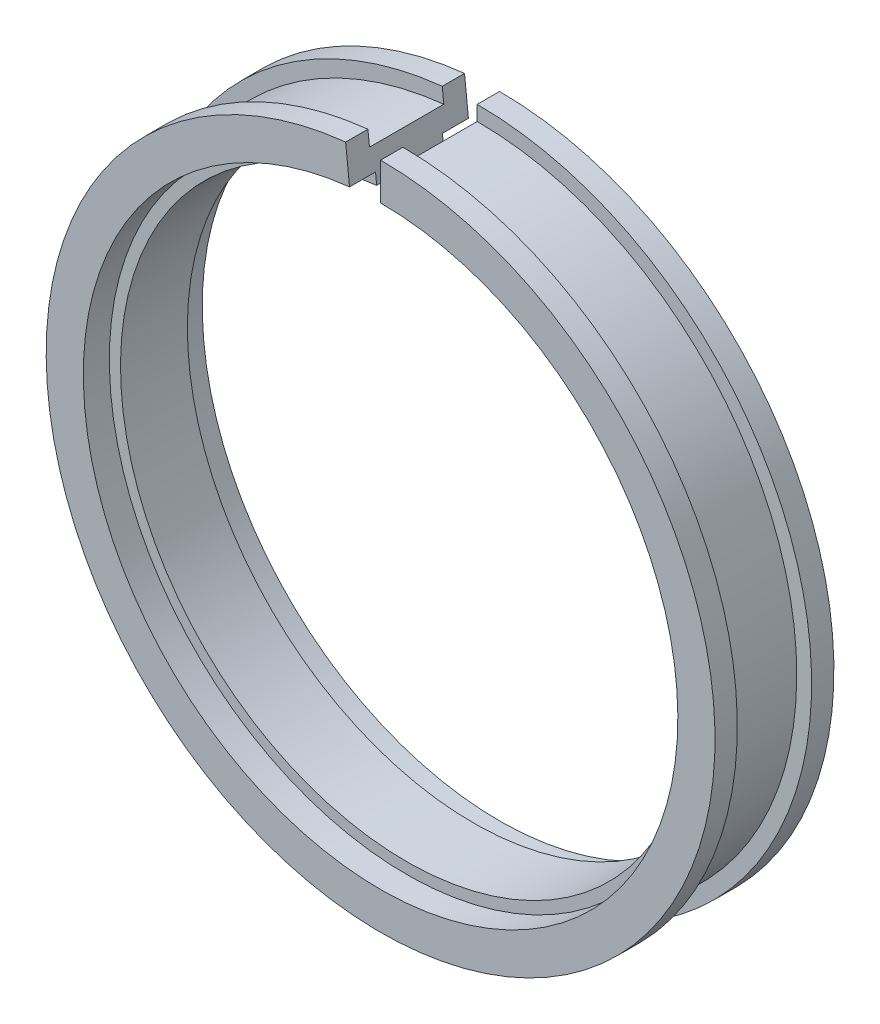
ISO-10303-21;
HEADER;
FILE_DESCRIPTION(('STEP AP214'),'2;1');
FILE_NAME('part.step','',(''),(''),'','','');
FILE_SCHEMA(('AUTOMOTIVE_DESIGN { 1 0 10303 214 1 1 1 1 }'));
ENDSEC;
DATA;
#1=APPLICATION_CONTEXT('core data for automotive mechanical design processes');
#2=APPLICATION_PROTOCOL_DEFINITION('international standard','automotive_design',2000,#1);
#3=PRODUCT_CONTEXT('',#1,'mechanical');
#4=PRODUCT('Part','Part','',(#3));
#5=PRODUCT_RELATED_PRODUCT_CATEGORY('part','',(#4));
#6=PRODUCT_DEFINITION_FORMATION('','',#4);
#7=PRODUCT_DEFINITION_CONTEXT('part definition',#1,'design');
#8=PRODUCT_DEFINITION('design','',#6,#7);
#9=PRODUCT_DEFINITION_SHAPE('','',#8);
#10=(LENGTH_UNIT() NAMED_UNIT(*) SI_UNIT(.MILLI.,.METRE.));
#11=(NAMED_UNIT(*) PLANE_ANGLE_UNIT() SI_UNIT($,.RADIAN.));
#12=(NAMED_UNIT(*) SI_UNIT($,.STERADIAN.) SOLID_ANGLE_UNIT());
#13=UNCERTAINTY_MEASURE_WITH_UNIT(LENGTH_MEASURE(1.E-05),#10,'distance_accuracy_value','');
#14=(GEOMETRIC_REPRESENTATION_CONTEXT(3) GLOBAL_UNCERTAINTY_ASSIGNED_CONTEXT((#13)) GLOBAL_UNIT_ASSIGNED_CONTEXT((#10,
#11,#12)) REPRESENTATION_CONTEXT('',''));
#15=CARTESIAN_POINT('',(0.,0.,0.));
#16=DIRECTION('',(0.,0.,1.));
#17=DIRECTION('',(1.,0.,0.));
#18=AXIS2_PLACEMENT_3D('',#15,#16,#17);
#19=CARTESIAN_POINT('',(0.,0.,0.));
#20=DIRECTION('',(0.,0.,1.));
#21=DIRECTION('',(1.,0.,0.));
#22=AXIS2_PLACEMENT_3D('',#19,#20,#21);
#23=CYLINDRICAL_SURFACE('',#22,45.);
#24=CARTESIAN_POINT('',(0.,0.,-3.));
#25=DIRECTION('',(0.,0.,1.));
#26=DIRECTION('',(1.,0.,0.));
#27=AXIS2_PLACEMENT_3D('',#24,#25,#26);
#28=CIRCLE('',#27,45.);
#29=CARTESIAN_POINT('',(-4.70378084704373,44.7534852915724,-3.));
#30=VERTEX_POINT('',#29);
#31=CARTESIAN_POINT('',(0.,45.,-3.));
#32=VERTEX_POINT('',#31);
#33=EDGE_CURVE('E11',#30,#32,#28,.T.);
#34=ORIENTED_EDGE('',*,*,#33,.T.);
#35=DIRECTION('',(0.,0.,1.));
#36=VECTOR('',#35,1.);
#37=CARTESIAN_POINT('',(0.,45.,0.));
#38=LINE('',#37,#36);
#39=CARTESIAN_POINT('',(0.,45.,0.));
#40=VERTEX_POINT('',#39);
#41=EDGE_CURVE('E139',#32,#40,#38,.T.);
#42=ORIENTED_EDGE('',*,*,#41,.T.);
#43=CARTESIAN_POINT('',(0.,0.,0.));
#44=DIRECTION('',(0.,0.,1.));
#45=DIRECTION('',(1.,0.,0.));
#46=AXIS2_PLACEMENT_3D('',#43,#44,#45);
#47=CIRCLE('',#46,45.);
#48=CARTESIAN_POINT('',(-4.70378084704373,44.7534852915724,0.));
#49=VERTEX_POINT('',#48);
#50=EDGE_CURVE('E121',#49,#40,#47,.T.);
#51=ORIENTED_EDGE('',*,*,#50,.F.);
#52=DIRECTION('',(0.,0.,1.));
#53=VECTOR('',#52,1.);
#54=CARTESIAN_POINT('',(-4.70378084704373,44.7534852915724,0.));
#55=LINE('',#54,#53);
#56=EDGE_CURVE('E172',#30,#49,#55,.T.);
#57=ORIENTED_EDGE('',*,*,#56,.F.);
#58=EDGE_LOOP('',(#34,#42,#51,#57));
#59=FACE_BOUND('',#58,.T.);
#60=ADVANCED_FACE('F33',(#59),#23,.T.);
#61=CARTESIAN_POINT('',(-4.70378084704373,44.7534852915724,-3.));
#62=DIRECTION('',(0.,0.,1.));
#63=DIRECTION('',(1.,0.,0.));
#64=AXIS2_PLACEMENT_3D('',#61,#62,#63);
#65=PLANE('',#64);
#66=CARTESIAN_POINT('',(0.,0.,-3.));
#67=DIRECTION('',(0.,0.,1.));
#68=DIRECTION('',(1.,0.,0.));
#69=AXIS2_PLACEMENT_3D('',#66,#67,#68);
#70=CIRCLE('',#69,43.);
#71=CARTESIAN_POINT('',(-4.49472392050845,42.7644415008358,-3.));
#72=VERTEX_POINT('',#71);
#73=CARTESIAN_POINT('',(0.,43.,-3.));
#74=VERTEX_POINT('',#73);
#75=EDGE_CURVE('E41',#72,#74,#70,.T.);
#76=ORIENTED_EDGE('',*,*,#75,.T.);
#77=DIRECTION('',(0.,1.,0.));
#78=VECTOR('',#77,1.);
#79=CARTESIAN_POINT('',(0.,45.,-3.));
#80=LINE('',#79,#78);
#81=EDGE_CURVE('E170',#74,#32,#80,.T.);
#82=ORIENTED_EDGE('',*,*,#81,.T.);
#83=ORIENTED_EDGE('',*,*,#33,.F.);
#84=DIRECTION('',(-0.104528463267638,0.994521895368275,0.));
#85=VECTOR('',#84,1.);
#86=CARTESIAN_POINT('',(-4.70378084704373,44.7534852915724,-3.));
#87=LINE('',#86,#85);
#88=EDGE_CURVE('E133',#72,#30,#87,.T.);
#89=ORIENTED_EDGE('',*,*,#88,.F.);
#90=EDGE_LOOP('',(#76,#82,#83,#89));
#91=FACE_BOUND('',#90,.T.);
#92=ADVANCED_FACE('F35',(#91),#65,.F.);
#93=CARTESIAN_POINT('',(0.,0.,0.));
#94=DIRECTION('',(0.,0.,1.));
#95=DIRECTION('',(1.,0.,0.));
#96=AXIS2_PLACEMENT_3D('',#93,#94,#95);
#97=CYLINDRICAL_SURFACE('',#96,43.);
#98=CARTESIAN_POINT('',(0.,0.,-13.));
#99=DIRECTION('',(0.,0.,1.));
#100=DIRECTION('',(1.,0.,0.));
#101=AXIS2_PLACEMENT_3D('',#98,#99,#100);
#102=CIRCLE('',#101,43.);
#103=CARTESIAN_POINT('',(-4.49472392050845,42.7644415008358,-13.));
#104=VERTEX_POINT('',#103);
#105=CARTESIAN_POINT('',(0.,43.,-13.));
#106=VERTEX_POINT('',#105);
#107=EDGE_CURVE('E217',#104,#106,#102,.T.);
#108=ORIENTED_EDGE('',*,*,#107,.T.);
#109=DIRECTION('',(0.,0.,1.));
#110=VECTOR('',#109,1.);
#111=CARTESIAN_POINT('',(0.,43.,-3.));
#112=LINE('',#111,#110);
#113=EDGE_CURVE('E168',#106,#74,#112,.T.);
#114=ORIENTED_EDGE('',*,*,#113,.T.);
#115=ORIENTED_EDGE('',*,*,#75,.F.);
#116=DIRECTION('',(0.,0.,1.));
#117=VECTOR('',#116,1.);
#118=CARTESIAN_POINT('',(-4.49472392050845,42.7644415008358,-3.));
#119=LINE('',#118,#117);
#120=EDGE_CURVE('E199',#104,#72,#119,.T.);
#121=ORIENTED_EDGE('',*,*,#120,.F.);
#122=EDGE_LOOP('',(#108,#114,#115,#121));
#123=FACE_BOUND('',#122,.T.);
#124=ADVANCED_FACE('F219',(#123),#97,.T.);
#125=CARTESIAN_POINT('',(-4.49472392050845,42.7644415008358,-13.));
#126=DIRECTION('',(0.,0.,-1.));
#127=DIRECTION('',(-1.,0.,0.));
#128=AXIS2_PLACEMENT_3D('',#125,#126,#127);
#129=PLANE('',#128);
#130=CARTESIAN_POINT('',(0.,0.,-13.));
#131=DIRECTION('',(0.,0.,1.));
#132=DIRECTION('',(1.,0.,0.));
#133=AXIS2_PLACEMENT_3D('',#130,#131,#132);
#134=CIRCLE('',#133,45.);
#135=CARTESIAN_POINT('',(-4.70378084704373,44.7534852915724,-13.));
#136=VERTEX_POINT('',#135);
#137=CARTESIAN_POINT('',(0.,45.,-13.));
#138=VERTEX_POINT('',#137);
#139=EDGE_CURVE('E215',#136,#138,#134,.T.);
#140=ORIENTED_EDGE('',*,*,#139,.T.);
#141=DIRECTION('',(0.,-1.,0.));
#142=VECTOR('',#141,1.);
#143=CARTESIAN_POINT('',(0.,43.,-13.));
#144=LINE('',#143,#142);
#145=EDGE_CURVE('E165',#138,#106,#144,.T.);
#146=ORIENTED_EDGE('',*,*,#145,.T.);
#147=ORIENTED_EDGE('',*,*,#107,.F.);
#148=DIRECTION('',(0.104528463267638,-0.994521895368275,0.));
#149=VECTOR('',#148,1.);
#150=CARTESIAN_POINT('',(-4.49472392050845,42.7644415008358,-13.));
#151=LINE('',#150,#149);
#152=EDGE_CURVE('E196',#136,#104,#151,.T.);
#153=ORIENTED_EDGE('',*,*,#152,.F.);
#154=EDGE_LOOP('',(#140,#146,#147,#153));
#155=FACE_BOUND('',#154,.T.);
#156=ADVANCED_FACE('F224',(#155),#129,.F.);
#157=CARTESIAN_POINT('',(0.,0.,0.));
#158=DIRECTION('',(0.,0.,1.));
#159=DIRECTION('',(1.,0.,0.));
#160=AXIS2_PLACEMENT_3D('',#157,#158,#159);
#161=CYLINDRICAL_SURFACE('',#160,45.);
#162=CARTESIAN_POINT('',(0.,0.,-16.));
#163=DIRECTION('',(0.,0.,1.));
#164=DIRECTION('',(1.,0.,0.));
#165=AXIS2_PLACEMENT_3D('',#162,#163,#164);
#166=CIRCLE('',#165,45.);
#167=CARTESIAN_POINT('',(-4.70378084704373,44.7534852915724,-16.));
#168=VERTEX_POINT('',#167);
#169=CARTESIAN_POINT('',(0.,45.,-16.));
#170=VERTEX_POINT('',#169);
#171=EDGE_CURVE('E213',#168,#170,#166,.T.);
#172=ORIENTED_EDGE('',*,*,#171,.T.);
#173=DIRECTION('',(0.,0.,1.));
#174=VECTOR('',#173,1.);
#175=CARTESIAN_POINT('',(0.,45.,-13.));
#176=LINE('',#175,#174);
#177=EDGE_CURVE('E162',#170,#138,#176,.T.);
#178=ORIENTED_EDGE('',*,*,#177,.T.);
#179=ORIENTED_EDGE('',*,*,#139,.F.);
#180=DIRECTION('',(0.,0.,1.));
#181=VECTOR('',#180,1.);
#182=CARTESIAN_POINT('',(-4.70378084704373,44.7534852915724,-13.));
#183=LINE('',#182,#181);
#184=EDGE_CURVE('E193',#168,#136,#183,.T.);
#185=ORIENTED_EDGE('',*,*,#184,.F.);
#186=EDGE_LOOP('',(#172,#178,#179,#185));
#187=FACE_BOUND('',#186,.T.);
#188=ADVANCED_FACE('F228',(#187),#161,.T.);
#189=CARTESIAN_POINT('',(-4.70378084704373,44.7534852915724,-16.));
#190=DIRECTION('',(0.,0.,1.));
#191=DIRECTION('',(1.,0.,0.));
#192=AXIS2_PLACEMENT_3D('',#189,#190,#191);
#193=PLANE('',#192);
#194=CARTESIAN_POINT('',(0.,0.,-16.));
#195=DIRECTION('',(0.,0.,1.));
#196=DIRECTION('',(1.,0.,0.));
#197=AXIS2_PLACEMENT_3D('',#194,#195,#196);
#198=CIRCLE('',#197,40.);
#199=CARTESIAN_POINT('',(-4.18113853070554,39.780875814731,-16.));
#200=VERTEX_POINT('',#199);
#201=CARTESIAN_POINT('',(0.,40.,-16.));
#202=VERTEX_POINT('',#201);
#203=EDGE_CURVE('E211',#200,#202,#198,.T.);
#204=ORIENTED_EDGE('',*,*,#203,.T.);
#205=DIRECTION('',(0.,1.,0.));
#206=VECTOR('',#205,1.);
#207=CARTESIAN_POINT('',(0.,45.,-16.));
#208=LINE('',#207,#206);
#209=EDGE_CURVE('E159',#202,#170,#208,.T.);
#210=ORIENTED_EDGE('',*,*,#209,.T.);
#211=ORIENTED_EDGE('',*,*,#171,.F.);
#212=DIRECTION('',(-0.104528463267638,0.994521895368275,0.));
#213=VECTOR('',#212,1.);
#214=CARTESIAN_POINT('',(-4.70378084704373,44.7534852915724,-16.));
#215=LINE('',#214,#213);
#216=EDGE_CURVE('E190',#200,#168,#215,.T.);
#217=ORIENTED_EDGE('',*,*,#216,.F.);
#218=EDGE_LOOP('',(#204,#210,#211,#217));
#219=FACE_BOUND('',#218,.T.);
#220=ADVANCED_FACE('F231',(#219),#193,.F.);
#221=CARTESIAN_POINT('',(0.,0.,0.));
#222=DIRECTION('',(0.,0.,1.));
#223=DIRECTION('',(1.,0.,0.));
#224=AXIS2_PLACEMENT_3D('',#221,#222,#223);
#225=CYLINDRICAL_SURFACE('',#224,40.);
#226=CARTESIAN_POINT('',(0.,0.,-12.5));
#227=DIRECTION('',(0.,0.,1.));
#228=DIRECTION('',(1.,0.,0.));
#229=AXIS2_PLACEMENT_3D('',#226,#227,#228);
#230=CIRCLE('',#229,40.);
#231=CARTESIAN_POINT('',(-4.18113853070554,39.780875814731,-12.5));
#232=VERTEX_POINT('',#231);
#233=CARTESIAN_POINT('',(0.,40.,-12.5));
#234=VERTEX_POINT('',#233);
#235=EDGE_CURVE('E209',#232,#234,#230,.T.);
#236=ORIENTED_EDGE('',*,*,#235,.T.);
#237=DIRECTION('',(0.,0.,-1.));
#238=VECTOR('',#237,1.);
#239=CARTESIAN_POINT('',(0.,40.,-16.));
#240=LINE('',#239,#238);
#241=EDGE_CURVE('E156',#234,#202,#240,.T.);
#242=ORIENTED_EDGE('',*,*,#241,.T.);
#243=ORIENTED_EDGE('',*,*,#203,.F.);
#244=DIRECTION('',(0.,0.,-1.));
#245=VECTOR('',#244,1.);
#246=CARTESIAN_POINT('',(-4.18113853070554,39.780875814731,-16.));
#247=LINE('',#246,#245);
#248=EDGE_CURVE('E187',#232,#200,#247,.T.);
#249=ORIENTED_EDGE('',*,*,#248,.F.);
#250=EDGE_LOOP('',(#236,#242,#243,#249));
#251=FACE_BOUND('',#250,.T.);
#252=ADVANCED_FACE('F236',(#251),#225,.F.);
#253=CARTESIAN_POINT('',(-4.18113853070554,39.780875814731,-12.5));
#254=DIRECTION('',(0.,0.,1.));
#255=DIRECTION('',(1.,0.,0.));
#256=AXIS2_PLACEMENT_3D('',#253,#254,#255);
#257=PLANE('',#256);
#258=CARTESIAN_POINT('',(0.,0.,-12.5));
#259=DIRECTION('',(0.,0.,1.));
#260=DIRECTION('',(1.,0.,0.));
#261=AXIS2_PLACEMENT_3D('',#258,#259,#260);
#262=CIRCLE('',#261,38.5);
#263=CARTESIAN_POINT('',(-4.02434583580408,38.2890929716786,-12.5));
#264=VERTEX_POINT('',#263);
#265=CARTESIAN_POINT('',(0.,38.5,-12.5));
#266=VERTEX_POINT('',#265);
#267=EDGE_CURVE('E207',#264,#266,#262,.T.);
#268=ORIENTED_EDGE('',*,*,#267,.T.);
#269=DIRECTION('',(0.,1.,0.));
#270=VECTOR('',#269,1.);
#271=CARTESIAN_POINT('',(0.,40.,-12.5));
#272=LINE('',#271,#270);
#273=EDGE_CURVE('E153',#266,#234,#272,.T.);
#274=ORIENTED_EDGE('',*,*,#273,.T.);
#275=ORIENTED_EDGE('',*,*,#235,.F.);
#276=DIRECTION('',(-0.104528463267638,0.994521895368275,0.));
#277=VECTOR('',#276,1.);
#278=CARTESIAN_POINT('',(-4.18113853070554,39.780875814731,-12.5));
#279=LINE('',#278,#277);
#280=EDGE_CURVE('E184',#264,#232,#279,.T.);
#281=ORIENTED_EDGE('',*,*,#280,.F.);
#282=EDGE_LOOP('',(#268,#274,#275,#281));
#283=FACE_BOUND('',#282,.T.);
#284=ADVANCED_FACE('F240',(#283),#257,.F.);
#285=CARTESIAN_POINT('',(0.,0.,0.));
#286=DIRECTION('',(0.,0.,1.));
#287=DIRECTION('',(1.,0.,0.));
#288=AXIS2_PLACEMENT_3D('',#285,#286,#287);
#289=CYLINDRICAL_SURFACE('',#288,38.5);
#290=CARTESIAN_POINT('',(0.,0.,-3.5));
#291=DIRECTION('',(0.,0.,1.));
#292=DIRECTION('',(1.,0.,0.));
#293=AXIS2_PLACEMENT_3D('',#290,#291,#292);
#294=CIRCLE('',#293,38.5);
#295=CARTESIAN_POINT('',(-4.02434583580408,38.2890929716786,-3.5));
#296=VERTEX_POINT('',#295);
#297=CARTESIAN_POINT('',(0.,38.5,-3.5));
#298=VERTEX_POINT('',#297);
#299=EDGE_CURVE('E205',#296,#298,#294,.T.);
#300=ORIENTED_EDGE('',*,*,#299,.T.);
#301=DIRECTION('',(0.,0.,-1.));
#302=VECTOR('',#301,1.);
#303=CARTESIAN_POINT('',(0.,38.5,-12.5));
#304=LINE('',#303,#302);
#305=EDGE_CURVE('E150',#298,#266,#304,.T.);
#306=ORIENTED_EDGE('',*,*,#305,.T.);
#307=ORIENTED_EDGE('',*,*,#267,.F.);
#308=DIRECTION('',(0.,0.,-1.));
#309=VECTOR('',#308,1.);
#310=CARTESIAN_POINT('',(-4.02434583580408,38.2890929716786,-12.5));
#311=LINE('',#310,#309);
#312=EDGE_CURVE('E181',#296,#264,#311,.T.);
#313=ORIENTED_EDGE('',*,*,#312,.F.);
#314=EDGE_LOOP('',(#300,#306,#307,#313));
#315=FACE_BOUND('',#314,.T.);
#316=ADVANCED_FACE('F243',(#315),#289,.F.);
#317=CARTESIAN_POINT('',(-4.02434583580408,38.2890929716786,-3.5));
#318=DIRECTION('',(0.,0.,-1.));
#319=DIRECTION('',(-1.,0.,0.));
#320=AXIS2_PLACEMENT_3D('',#317,#318,#319);
#321=PLANE('',#320);
#322=CARTESIAN_POINT('',(0.,0.,-3.5));
#323=DIRECTION('',(0.,0.,1.));
#324=DIRECTION('',(1.,0.,0.));
#325=AXIS2_PLACEMENT_3D('',#322,#323,#324);
#326=CIRCLE('',#325,40.);
#327=CARTESIAN_POINT('',(-4.18113853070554,39.780875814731,-3.5));
#328=VERTEX_POINT('',#327);
#329=CARTESIAN_POINT('',(0.,40.,-3.5));
#330=VERTEX_POINT('',#329);
#331=EDGE_CURVE('E203',#328,#330,#326,.T.);
#332=ORIENTED_EDGE('',*,*,#331,.T.);
#333=DIRECTION('',(0.,-1.,0.));
#334=VECTOR('',#333,1.);
#335=CARTESIAN_POINT('',(0.,38.5,-3.5));
#336=LINE('',#335,#334);
#337=EDGE_CURVE('E147',#330,#298,#336,.T.);
#338=ORIENTED_EDGE('',*,*,#337,.T.);
#339=ORIENTED_EDGE('',*,*,#299,.F.);
#340=DIRECTION('',(0.104528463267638,-0.994521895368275,0.));
#341=VECTOR('',#340,1.);
#342=CARTESIAN_POINT('',(-4.02434583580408,38.2890929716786,-3.5));
#343=LINE('',#342,#341);
#344=EDGE_CURVE('E178',#328,#296,#343,.T.);
#345=ORIENTED_EDGE('',*,*,#344,.F.);
#346=EDGE_LOOP('',(#332,#338,#339,#345));
#347=FACE_BOUND('',#346,.T.);
#348=ADVANCED_FACE('F245',(#347),#321,.F.);
#349=CARTESIAN_POINT('',(0.,0.,0.));
#350=DIRECTION('',(0.,0.,1.));
#351=DIRECTION('',(1.,0.,0.));
#352=AXIS2_PLACEMENT_3D('',#349,#350,#351);
#353=CYLINDRICAL_SURFACE('',#352,40.);
#354=CARTESIAN_POINT('',(0.,0.,0.));
#355=DIRECTION('',(0.,0.,1.));
#356=DIRECTION('',(1.,0.,0.));
#357=AXIS2_PLACEMENT_3D('',#354,#355,#356);
#358=CIRCLE('',#357,40.);
#359=CARTESIAN_POINT('',(-4.18113853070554,39.780875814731,0.));
#360=VERTEX_POINT('',#359);
#361=CARTESIAN_POINT('',(0.,40.,0.));
#362=VERTEX_POINT('',#361);
#363=EDGE_CURVE('E132',#360,#362,#358,.T.);
#364=ORIENTED_EDGE('',*,*,#363,.T.);
#365=DIRECTION('',(0.,0.,-1.));
#366=VECTOR('',#365,1.);
#367=CARTESIAN_POINT('',(0.,40.,-3.5));
#368=LINE('',#367,#366);
#369=EDGE_CURVE('E142',#362,#330,#368,.T.);
#370=ORIENTED_EDGE('',*,*,#369,.T.);
#371=ORIENTED_EDGE('',*,*,#331,.F.);
#372=DIRECTION('',(0.,0.,-1.));
#373=VECTOR('',#372,1.);
#374=CARTESIAN_POINT('',(-4.18113853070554,39.780875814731,-3.5));
#375=LINE('',#374,#373);
#376=EDGE_CURVE('E175',#360,#328,#375,.T.);
#377=ORIENTED_EDGE('',*,*,#376,.F.);
#378=EDGE_LOOP('',(#364,#370,#371,#377));
#379=FACE_BOUND('',#378,.T.);
#380=ADVANCED_FACE('F249',(#379),#353,.F.);
#381=CARTESIAN_POINT('',(-4.18113853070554,39.780875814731,0.));
#382=DIRECTION('',(0.,0.,-1.));
#383=DIRECTION('',(-1.,0.,0.));
#384=AXIS2_PLACEMENT_3D('',#381,#382,#383);
#385=PLANE('',#384);
#386=DIRECTION('',(0.104528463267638,-0.994521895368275,0.));
#387=VECTOR('',#386,1.);
#388=CARTESIAN_POINT('',(-4.18113853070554,39.780875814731,0.));
#389=LINE('',#388,#387);
#390=EDGE_CURVE('E127',#49,#360,#389,.T.);
#391=ORIENTED_EDGE('',*,*,#390,.F.);
#392=ORIENTED_EDGE('',*,*,#50,.T.);
#393=DIRECTION('',(0.,-1.,0.));
#394=VECTOR('',#393,1.);
#395=CARTESIAN_POINT('',(0.,40.,0.));
#396=LINE('',#395,#394);
#397=EDGE_CURVE('E124',#40,#362,#396,.T.);
#398=ORIENTED_EDGE('',*,*,#397,.T.);
#399=ORIENTED_EDGE('',*,*,#363,.F.);
#400=EDGE_LOOP('',(#391,#392,#398,#399));
#401=FACE_BOUND('',#400,.T.);
#402=ADVANCED_FACE('F123',(#401),#385,.F.);
#403=CARTESIAN_POINT('',(-4.70378084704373,44.7534852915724,-3.));
#404=DIRECTION('',(-0.994521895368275,-0.104528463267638,0.));
#405=DIRECTION('',(0.,0.,1.));
#406=AXIS2_PLACEMENT_3D('',#403,#404,#405);
#407=PLANE('',#406);
#408=ORIENTED_EDGE('',*,*,#56,.T.);
#409=ORIENTED_EDGE('',*,*,#390,.T.);
#410=ORIENTED_EDGE('',*,*,#376,.T.);
#411=ORIENTED_EDGE('',*,*,#344,.T.);
#412=ORIENTED_EDGE('',*,*,#312,.T.);
#413=ORIENTED_EDGE('',*,*,#280,.T.);
#414=ORIENTED_EDGE('',*,*,#248,.T.);
#415=ORIENTED_EDGE('',*,*,#216,.T.);
#416=ORIENTED_EDGE('',*,*,#184,.T.);
#417=ORIENTED_EDGE('',*,*,#152,.T.);
#418=ORIENTED_EDGE('',*,*,#120,.T.);
#419=ORIENTED_EDGE('',*,*,#88,.T.);
#420=EDGE_LOOP('',(#408,#409,#410,#411,#412,#413,#414,#415,#416,#417,#418,#419));
#421=FACE_BOUND('',#420,.T.);
#422=ADVANCED_FACE('F251',(#421),#407,.F.);
#423=CARTESIAN_POINT('',(0.,45.,-3.));
#424=DIRECTION('',(-1.,0.,0.));
#425=DIRECTION('',(0.,0.,1.));
#426=AXIS2_PLACEMENT_3D('',#423,#424,#425);
#427=PLANE('',#426);
#428=ORIENTED_EDGE('',*,*,#41,.F.);
#429=ORIENTED_EDGE('',*,*,#81,.F.);
#430=ORIENTED_EDGE('',*,*,#113,.F.);
#431=ORIENTED_EDGE('',*,*,#145,.F.);
#432=ORIENTED_EDGE('',*,*,#177,.F.);
#433=ORIENTED_EDGE('',*,*,#209,.F.);
#434=ORIENTED_EDGE('',*,*,#241,.F.);
#435=ORIENTED_EDGE('',*,*,#273,.F.);
#436=ORIENTED_EDGE('',*,*,#305,.F.);
#437=ORIENTED_EDGE('',*,*,#337,.F.);
#438=ORIENTED_EDGE('',*,*,#369,.F.);
#439=ORIENTED_EDGE('',*,*,#397,.F.);
#440=EDGE_LOOP('',(#428,#429,#430,#431,#432,#433,#434,#435,#436,#437,#438,#439));
#441=FACE_BOUND('',#440,.T.);
#442=ADVANCED_FACE('F137',(#441),#427,.T.);
#443=CLOSED_SHELL('',(#60,#92,#124,#156,#188,#220,#252,#284,#316,#348,#380,#402,#422,#442));
#444=MANIFOLD_SOLID_BREP('B2',#443);
#445=ADVANCED_BREP_SHAPE_REPRESENTATION('',(#18,#444),#14);
#446=SHAPE_DEFINITION_REPRESENTATION(#9,#445);
ENDSEC;
END-ISO-10303-21;
